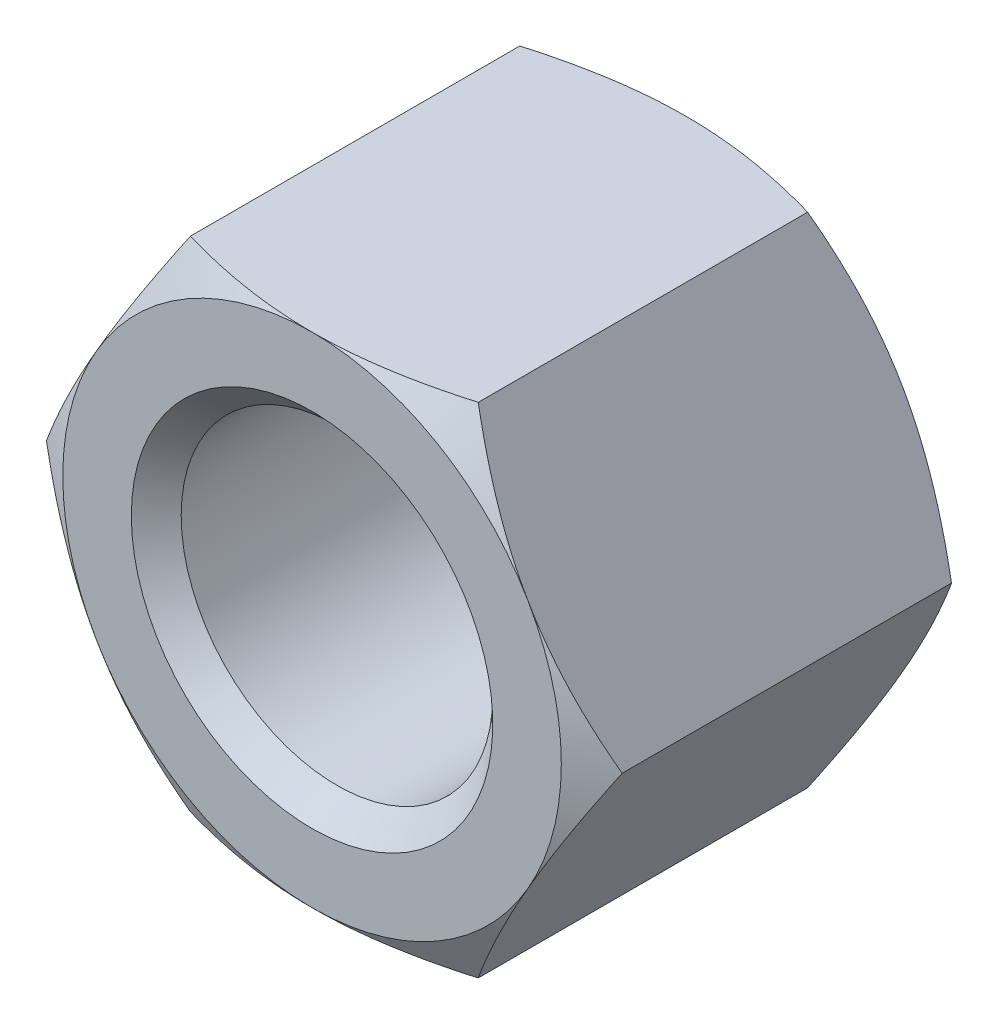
from build123d import *

# Parameters (mm, degrees)
BOSS_EXTRUDE1_DEPTH      = 3
SKETCH2_OUTSIDE_W        = 40.798
SKETCH2_OUTSIDE_H        = 39.56
SKETCH2_OUTSIDE_R        = 4
CUT_EXTRUDE1_DEPTH       = 7.806859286
CUT_EXTRUDE1_DRAFT       = -60
SKETCH3_R                = 2.5
SKETCH3_R_2              = 2.1
CUT_EXTRUDE2_DEPTH       = 3
SKETCH3_2_R              = 2.1
CUT_EXTRUDE3_DEPTH       = 4.2
CHAMFER1_SIZE            = 0.4
MIRROR1_COPY_1_SKETCH_W  = 40.798
MIRROR1_COPY_1_SKETCH_H  = 39.56
MIRROR1_COPY_1_SKETCH_R  = 4
MIRROR1_COPY_1_DEPTH     = 7.806859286
MIRROR1_COPY_1_DRAFT     = -60
CHAMFER1_OF_MIRROR1_SIZE = 0.4


with BuildPart() as part:
    # Sketch1 → Boss-Extrude1 (new body)
    with BuildSketch(Plane.XY):
        Polygon((2.309401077, 4), (-2.309401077, 4), (-4.618802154, 0), (-2.309401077, -4), (2.309401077, -4), (4.618802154, 0), align=None)
    boss_extrude1 = extrude(amount=-BOSS_EXTRUDE1_DEPTH)


with BuildPart() as cut_extrude1_tool:
    # Sketch2 outside → Cut-Extrude1 (with draft: the straight prism first)
    with BuildSketch(Plane(origin=(0, 0, -3), x_dir=(-1, 0, 0), z_dir=(0, 0, -1))):
        Rectangle(SKETCH2_OUTSIDE_W, SKETCH2_OUTSIDE_H)
        Circle(SKETCH2_OUTSIDE_R, mode=Mode.SUBTRACT)
    extrude(amount=-CUT_EXTRUDE1_DEPTH)
    # Cut-Extrude1: the draft: its side faces are tilted about the plane it starts from
    cut_extrude1_sides = [cut_extrude1_tool.faces().sort_by_distance(p)[0] for p in [
        (0, -19.78, 0.903429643),
        (-20.399, 0, 0.903429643),
        (0, 19.78, 0.903429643),
        (20.399, 0, 0.903429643),
        (4, 0, 0.903429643),
    ]]
    draft(cut_extrude1_sides, Plane(origin=(0, 0, -3), x_dir=(-1, 0, 0), z_dir=(0, 0, -1)), CUT_EXTRUDE1_DRAFT)


with BuildPart() as part_1:
    add(part.part)

    # Cut-Extrude1: cut by cut_extrude1_tool
    add(cut_extrude1_tool.part, mode=Mode.SUBTRACT)

    # Sketch3 → Cut-Extrude2 (cut)
    with BuildSketch(Plane(origin=(0, 0, -3), x_dir=(-1, 0, 0), z_dir=(0, 0, -1))):
        Circle(SKETCH3_R)
        Circle(SKETCH3_R_2, mode=Mode.SUBTRACT)
    cut_extrude2 = extrude(amount=-CUT_EXTRUDE2_DEPTH, mode=Mode.SUBTRACT)


with BuildPart() as cut_extrude2_piece_1:
    # of the separate pieces the step leaves, piece 1, a body of its own (cut_extrude2_pieces)
    add(part_1.part.solids().sort_by_distance((2.309401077, 4, 0))[0])

    # Chamfer1
    chamfer1_edges = [cut_extrude2_piece_1.edges().sort_by_distance(p)[0] for p in [
        (2.5, 0, -3),
    ]]
    chamfer(chamfer1_edges, length=CHAMFER1_SIZE)


with BuildPart() as cut_extrude2_piece_2:
    # of the separate pieces the step leaves, piece 2, a body of its own (cut_extrude2_pieces)
    add(part_1.part.solids().sort_by_distance((-2.1, 0, 0))[0])

    # Sketch3_2 → Cut-Extrude3 (cut)
    with BuildSketch(Plane(origin=(0, 0, -3), x_dir=(-1, 0, 0), z_dir=(0, 0, -1))):
        Circle(SKETCH3_2_R)
    cut_extrude3 = extrude(amount=-CUT_EXTRUDE3_DEPTH, mode=Mode.SUBTRACT)


with BuildPart() as cut_extrude2_piece_1_1:
    add(cut_extrude2_piece_1.part)

    # Mirror1: Boss-Extrude1, Cut-Extrude2, Cut-Extrude3 across plane
    add(boss_extrude1.mirror(Plane.XY))
    add(cut_extrude2.mirror(Plane.XY), mode=Mode.SUBTRACT)
    add(cut_extrude3.mirror(Plane.XY), mode=Mode.SUBTRACT)


with BuildPart() as mirror1_copy_1_tool:
    # Mirror1 copy 1 sketch → Mirror1 copy 1 (with draft: the straight prism first)
    with BuildSketch(Plane(origin=(0, 0, 3), x_dir=(-1, 0, 0), z_dir=(0, 0, 1))):
        Rectangle(MIRROR1_COPY_1_SKETCH_W, MIRROR1_COPY_1_SKETCH_H)
        Circle(MIRROR1_COPY_1_SKETCH_R, mode=Mode.SUBTRACT)
    extrude(amount=-MIRROR1_COPY_1_DEPTH)
    # Mirror1 copy 1: the draft: its side faces are tilted about the plane it starts from
    mirror1_copy_1_sides = [mirror1_copy_1_tool.faces().sort_by_distance(p)[0] for p in [
        (0, -19.78, -0.903429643),
        (-20.399, 0, -0.903429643),
        (0, 19.78, -0.903429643),
        (20.399, 0, -0.903429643),
        (4, 0, -0.903429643),
    ]]
    draft(mirror1_copy_1_sides, Plane(origin=(0, 0, 3), x_dir=(-1, 0, 0), z_dir=(0, 0, 1)), MIRROR1_COPY_1_DRAFT)


with BuildPart() as cut_extrude2_piece_1_2:
    add(cut_extrude2_piece_1_1.part)

    # Mirror1 copy 1: cut by mirror1_copy_1_tool
    add(mirror1_copy_1_tool.part, mode=Mode.SUBTRACT)

    # Chamfer1 of Mirror1
    chamfer1_of_mirror1_edges = [cut_extrude2_piece_1_2.edges().sort_by_distance(p)[0] for p in [
        (2.5, 0, 3),
    ]]
    chamfer(chamfer1_of_mirror1_edges, length=CHAMFER1_OF_MIRROR1_SIZE)


solid = cut_extrude2_piece_1_2.part
